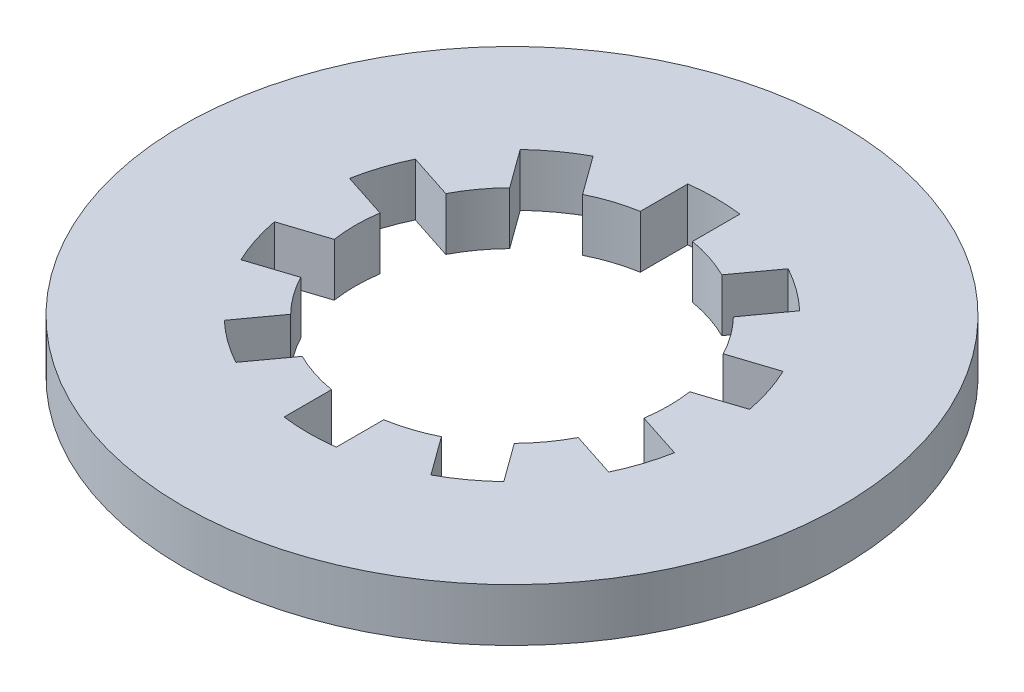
ISO-10303-21;
HEADER;
FILE_DESCRIPTION(('STEP AP214'),'2;1');
FILE_NAME('part.step','',(''),(''),'','','');
FILE_SCHEMA(('AUTOMOTIVE_DESIGN { 1 0 10303 214 1 1 1 1 }'));
ENDSEC;
DATA;
#1=APPLICATION_CONTEXT('core data for automotive mechanical design processes');
#2=APPLICATION_PROTOCOL_DEFINITION('international standard','automotive_design',2000,#1);
#3=PRODUCT_CONTEXT('',#1,'mechanical');
#4=PRODUCT('Part','Part','',(#3));
#5=PRODUCT_RELATED_PRODUCT_CATEGORY('part','',(#4));
#6=PRODUCT_DEFINITION_FORMATION('','',#4);
#7=PRODUCT_DEFINITION_CONTEXT('part definition',#1,'design');
#8=PRODUCT_DEFINITION('design','',#6,#7);
#9=PRODUCT_DEFINITION_SHAPE('','',#8);
#10=(LENGTH_UNIT() NAMED_UNIT(*) SI_UNIT(.MILLI.,.METRE.));
#11=(NAMED_UNIT(*) PLANE_ANGLE_UNIT() SI_UNIT($,.RADIAN.));
#12=(NAMED_UNIT(*) SI_UNIT($,.STERADIAN.) SOLID_ANGLE_UNIT());
#13=UNCERTAINTY_MEASURE_WITH_UNIT(LENGTH_MEASURE(1.E-05),#10,'distance_accuracy_value','');
#14=(GEOMETRIC_REPRESENTATION_CONTEXT(3) GLOBAL_UNCERTAINTY_ASSIGNED_CONTEXT((#13)) GLOBAL_UNIT_ASSIGNED_CONTEXT((#10,
#11,#12)) REPRESENTATION_CONTEXT('',''));
#15=CARTESIAN_POINT('',(0.,0.,0.));
#16=DIRECTION('',(0.,0.,1.));
#17=DIRECTION('',(1.,0.,0.));
#18=AXIS2_PLACEMENT_3D('',#15,#16,#17);
#19=CARTESIAN_POINT('',(0.,0.4064,0.));
#20=DIRECTION('',(0.,-1.,0.));
#21=DIRECTION('',(0.,0.,-1.));
#22=AXIS2_PLACEMENT_3D('',#19,#20,#21);
#23=CYLINDRICAL_SURFACE('',#22,1.2065);
#24=DIRECTION('',(0.,1.,0.));
#25=VECTOR('',#24,1.);
#26=CARTESIAN_POINT('',(-0.536564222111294,0.,1.08062069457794));
#27=LINE('',#26,#25);
#28=CARTESIAN_POINT('',(-0.536564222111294,0.,1.08062069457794));
#29=VERTEX_POINT('',#28);
#30=CARTESIAN_POINT('',(-0.536564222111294,0.4064,1.08062069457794));
#31=VERTEX_POINT('',#30);
#32=EDGE_CURVE('E555',#29,#31,#27,.T.);
#33=ORIENTED_EDGE('',*,*,#32,.T.);
#34=CARTESIAN_POINT('',(0.,0.4064,0.));
#35=DIRECTION('',(0.,1.,0.));
#36=DIRECTION('',(0.,0.,1.));
#37=AXIS2_PLACEMENT_3D('',#34,#35,#36);
#38=CIRCLE('',#37,1.2065);
#39=CARTESIAN_POINT('',(-0.201083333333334,0.4064,1.18962504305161));
#40=VERTEX_POINT('',#39);
#41=EDGE_CURVE('E324',#31,#40,#38,.T.);
#42=ORIENTED_EDGE('',*,*,#41,.T.);
#43=DIRECTION('',(0.,1.,0.));
#44=VECTOR('',#43,1.);
#45=CARTESIAN_POINT('',(-0.201083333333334,0.,1.18962504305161));
#46=LINE('',#45,#44);
#47=CARTESIAN_POINT('',(-0.201083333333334,0.,1.18962504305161));
#48=VERTEX_POINT('',#47);
#49=EDGE_CURVE('E330',#48,#40,#46,.T.);
#50=ORIENTED_EDGE('',*,*,#49,.F.);
#51=CARTESIAN_POINT('',(0.,0.,0.));
#52=DIRECTION('',(0.,1.,0.));
#53=DIRECTION('',(0.,0.,1.));
#54=AXIS2_PLACEMENT_3D('',#51,#52,#53);
#55=CIRCLE('',#54,1.2065);
#56=EDGE_CURVE('E316',#29,#48,#55,.T.);
#57=ORIENTED_EDGE('',*,*,#56,.F.);
#58=EDGE_LOOP('',(#33,#42,#50,#57));
#59=FACE_BOUND('',#58,.T.);
#60=ADVANCED_FACE('F34',(#59),#23,.F.);
#61=DIRECTION('',(0.,1.,0.));
#62=VECTOR('',#61,1.);
#63=CARTESIAN_POINT('',(-0.861923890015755,0.,0.844233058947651));
#64=LINE('',#63,#62);
#65=CARTESIAN_POINT('',(-0.861923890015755,0.,0.844233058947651));
#66=VERTEX_POINT('',#65);
#67=CARTESIAN_POINT('',(-0.861923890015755,0.4064,0.844233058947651));
#68=VERTEX_POINT('',#67);
#69=EDGE_CURVE('E294',#66,#68,#64,.T.);
#70=ORIENTED_EDGE('',*,*,#69,.F.);
#71=CARTESIAN_POINT('',(-1.06926248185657,0.,0.558855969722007));
#72=VERTEX_POINT('',#71);
#73=EDGE_CURVE('E306',#72,#66,#55,.T.);
#74=ORIENTED_EDGE('',*,*,#73,.F.);
#75=DIRECTION('',(0.,1.,0.));
#76=VECTOR('',#75,1.);
#77=CARTESIAN_POINT('',(-1.06926248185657,0.,0.558855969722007));
#78=LINE('',#77,#76);
#79=CARTESIAN_POINT('',(-1.06926248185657,0.4064,0.558855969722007));
#80=VERTEX_POINT('',#79);
#81=EDGE_CURVE('E531',#72,#80,#78,.T.);
#82=ORIENTED_EDGE('',*,*,#81,.T.);
#83=EDGE_CURVE('E308',#80,#68,#38,.T.);
#84=ORIENTED_EDGE('',*,*,#83,.T.);
#85=EDGE_LOOP('',(#70,#74,#82,#84));
#86=FACE_BOUND('',#85,.T.);
#87=ADVANCED_FACE('F304',(#86),#23,.F.);
#88=DIRECTION('',(0.,1.,0.));
#89=VECTOR('',#88,1.);
#90=CARTESIAN_POINT('',(-1.1935388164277,0.,0.176372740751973));
#91=LINE('',#90,#89);
#92=CARTESIAN_POINT('',(-1.1935388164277,0.,0.176372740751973));
#93=VERTEX_POINT('',#92);
#94=CARTESIAN_POINT('',(-1.1935388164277,0.4064,0.176372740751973));
#95=VERTEX_POINT('',#94);
#96=EDGE_CURVE('E539',#93,#95,#91,.T.);
#97=ORIENTED_EDGE('',*,*,#96,.F.);
#98=CARTESIAN_POINT('',(-1.1935388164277,0.,-0.176372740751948));
#99=VERTEX_POINT('',#98);
#100=EDGE_CURVE('E315',#99,#93,#55,.T.);
#101=ORIENTED_EDGE('',*,*,#100,.F.);
#102=DIRECTION('',(0.,1.,0.));
#103=VECTOR('',#102,1.);
#104=CARTESIAN_POINT('',(-1.1935388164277,0.,-0.176372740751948));
#105=LINE('',#104,#103);
#106=CARTESIAN_POINT('',(-1.1935388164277,0.4064,-0.176372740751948));
#107=VERTEX_POINT('',#106);
#108=EDGE_CURVE('E505',#99,#107,#105,.T.);
#109=ORIENTED_EDGE('',*,*,#108,.T.);
#110=EDGE_CURVE('E654',#107,#95,#38,.T.);
#111=ORIENTED_EDGE('',*,*,#110,.T.);
#112=EDGE_LOOP('',(#97,#101,#109,#111));
#113=FACE_BOUND('',#112,.T.);
#114=ADVANCED_FACE('F652',(#113),#23,.F.);
#115=DIRECTION('',(0.,1.,0.));
#116=VECTOR('',#115,1.);
#117=CARTESIAN_POINT('',(-1.06926248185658,0.,-0.558855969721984));
#118=LINE('',#117,#116);
#119=CARTESIAN_POINT('',(-1.06926248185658,0.,-0.558855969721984));
#120=VERTEX_POINT('',#119);
#121=CARTESIAN_POINT('',(-1.06926248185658,0.4064,-0.558855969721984));
#122=VERTEX_POINT('',#121);
#123=EDGE_CURVE('E513',#120,#122,#118,.T.);
#124=ORIENTED_EDGE('',*,*,#123,.F.);
#125=CARTESIAN_POINT('',(-0.861923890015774,0.,-0.844233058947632));
#126=VERTEX_POINT('',#125);
#127=EDGE_CURVE('E319',#126,#120,#55,.T.);
#128=ORIENTED_EDGE('',*,*,#127,.F.);
#129=DIRECTION('',(0.,1.,0.));
#130=VECTOR('',#129,1.);
#131=CARTESIAN_POINT('',(-0.861923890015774,0.,-0.844233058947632));
#132=LINE('',#131,#130);
#133=CARTESIAN_POINT('',(-0.861923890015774,0.4064,-0.844233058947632));
#134=VERTEX_POINT('',#133);
#135=EDGE_CURVE('E479',#126,#134,#132,.T.);
#136=ORIENTED_EDGE('',*,*,#135,.T.);
#137=EDGE_CURVE('E636',#134,#122,#38,.T.);
#138=ORIENTED_EDGE('',*,*,#137,.T.);
#139=EDGE_LOOP('',(#124,#128,#136,#138));
#140=FACE_BOUND('',#139,.T.);
#141=ADVANCED_FACE('F633',(#140),#23,.F.);
#142=DIRECTION('',(0.,1.,0.));
#143=VECTOR('',#142,1.);
#144=CARTESIAN_POINT('',(-0.536564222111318,0.,-1.08062069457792));
#145=LINE('',#144,#143);
#146=CARTESIAN_POINT('',(-0.536564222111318,0.,-1.08062069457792));
#147=VERTEX_POINT('',#146);
#148=CARTESIAN_POINT('',(-0.536564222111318,0.4064,-1.08062069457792));
#149=VERTEX_POINT('',#148);
#150=EDGE_CURVE('E487',#147,#149,#145,.T.);
#151=ORIENTED_EDGE('',*,*,#150,.F.);
#152=CARTESIAN_POINT('',(-0.201083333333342,0.,-1.18962504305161));
#153=VERTEX_POINT('',#152);
#154=EDGE_CURVE('E624',#153,#147,#55,.T.);
#155=ORIENTED_EDGE('',*,*,#154,.F.);
#156=DIRECTION('',(0.,1.,0.));
#157=VECTOR('',#156,1.);
#158=CARTESIAN_POINT('',(-0.201083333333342,0.,-1.18962504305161));
#159=LINE('',#158,#157);
#160=CARTESIAN_POINT('',(-0.201083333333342,0.4064,-1.18962504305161));
#161=VERTEX_POINT('',#160);
#162=EDGE_CURVE('E453',#153,#161,#159,.T.);
#163=ORIENTED_EDGE('',*,*,#162,.T.);
#164=EDGE_CURVE('E664',#161,#149,#38,.T.);
#165=ORIENTED_EDGE('',*,*,#164,.T.);
#166=EDGE_LOOP('',(#151,#155,#163,#165));
#167=FACE_BOUND('',#166,.T.);
#168=ADVANCED_FACE('F731',(#167),#23,.F.);
#169=DIRECTION('',(0.,1.,0.));
#170=VECTOR('',#169,1.);
#171=CARTESIAN_POINT('',(0.201083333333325,0.,-1.18962504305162));
#172=LINE('',#171,#170);
#173=CARTESIAN_POINT('',(0.201083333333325,0.,-1.18962504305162));
#174=VERTEX_POINT('',#173);
#175=CARTESIAN_POINT('',(0.201083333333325,0.4064,-1.18962504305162));
#176=VERTEX_POINT('',#175);
#177=EDGE_CURVE('E461',#174,#176,#172,.T.);
#178=ORIENTED_EDGE('',*,*,#177,.F.);
#179=CARTESIAN_POINT('',(0.536564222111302,0.,-1.08062069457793));
#180=VERTEX_POINT('',#179);
#181=EDGE_CURVE('E621',#180,#174,#55,.T.);
#182=ORIENTED_EDGE('',*,*,#181,.F.);
#183=DIRECTION('',(0.,1.,0.));
#184=VECTOR('',#183,1.);
#185=CARTESIAN_POINT('',(0.536564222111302,0.,-1.08062069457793));
#186=LINE('',#185,#184);
#187=CARTESIAN_POINT('',(0.536564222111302,0.4064,-1.08062069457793));
#188=VERTEX_POINT('',#187);
#189=EDGE_CURVE('E427',#180,#188,#186,.T.);
#190=ORIENTED_EDGE('',*,*,#189,.T.);
#191=EDGE_CURVE('E666',#188,#176,#38,.T.);
#192=ORIENTED_EDGE('',*,*,#191,.T.);
#193=EDGE_LOOP('',(#178,#182,#190,#192));
#194=FACE_BOUND('',#193,.T.);
#195=ADVANCED_FACE('F719',(#194),#23,.F.);
#196=DIRECTION('',(0.,1.,0.));
#197=VECTOR('',#196,1.);
#198=CARTESIAN_POINT('',(0.861923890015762,0.,-0.844233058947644));
#199=LINE('',#198,#197);
#200=CARTESIAN_POINT('',(0.861923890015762,0.,-0.844233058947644));
#201=VERTEX_POINT('',#200);
#202=CARTESIAN_POINT('',(0.861923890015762,0.4064,-0.844233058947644));
#203=VERTEX_POINT('',#202);
#204=EDGE_CURVE('E435',#201,#203,#199,.T.);
#205=ORIENTED_EDGE('',*,*,#204,.F.);
#206=CARTESIAN_POINT('',(1.06926248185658,0.,-0.558855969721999));
#207=VERTEX_POINT('',#206);
#208=EDGE_CURVE('E618',#207,#201,#55,.T.);
#209=ORIENTED_EDGE('',*,*,#208,.F.);
#210=DIRECTION('',(0.,1.,0.));
#211=VECTOR('',#210,1.);
#212=CARTESIAN_POINT('',(1.06926248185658,0.,-0.558855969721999));
#213=LINE('',#212,#211);
#214=CARTESIAN_POINT('',(1.06926248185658,0.4064,-0.558855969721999));
#215=VERTEX_POINT('',#214);
#216=EDGE_CURVE('E401',#207,#215,#213,.T.);
#217=ORIENTED_EDGE('',*,*,#216,.T.);
#218=EDGE_CURVE('E671',#215,#203,#38,.T.);
#219=ORIENTED_EDGE('',*,*,#218,.T.);
#220=EDGE_LOOP('',(#205,#209,#217,#219));
#221=FACE_BOUND('',#220,.T.);
#222=ADVANCED_FACE('F707',(#221),#23,.F.);
#223=DIRECTION('',(0.,1.,0.));
#224=VECTOR('',#223,1.);
#225=CARTESIAN_POINT('',(1.1935388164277,0.,-0.176372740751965));
#226=LINE('',#225,#224);
#227=CARTESIAN_POINT('',(1.1935388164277,0.,-0.176372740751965));
#228=VERTEX_POINT('',#227);
#229=CARTESIAN_POINT('',(1.1935388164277,0.4064,-0.176372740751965));
#230=VERTEX_POINT('',#229);
#231=EDGE_CURVE('E409',#228,#230,#226,.T.);
#232=ORIENTED_EDGE('',*,*,#231,.F.);
#233=CARTESIAN_POINT('',(1.1935388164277,0.,0.176372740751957));
#234=VERTEX_POINT('',#233);
#235=EDGE_CURVE('E616',#234,#228,#55,.T.);
#236=ORIENTED_EDGE('',*,*,#235,.F.);
#237=DIRECTION('',(0.,1.,0.));
#238=VECTOR('',#237,1.);
#239=CARTESIAN_POINT('',(1.1935388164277,0.,0.176372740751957));
#240=LINE('',#239,#238);
#241=CARTESIAN_POINT('',(1.1935388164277,0.4064,0.176372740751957));
#242=VERTEX_POINT('',#241);
#243=EDGE_CURVE('E375',#234,#242,#240,.T.);
#244=ORIENTED_EDGE('',*,*,#243,.T.);
#245=EDGE_CURVE('E676',#242,#230,#38,.T.);
#246=ORIENTED_EDGE('',*,*,#245,.T.);
#247=EDGE_LOOP('',(#232,#236,#244,#246));
#248=FACE_BOUND('',#247,.T.);
#249=ADVANCED_FACE('F695',(#248),#23,.F.);
#250=DIRECTION('',(0.,1.,0.));
#251=VECTOR('',#250,1.);
#252=CARTESIAN_POINT('',(1.06926248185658,0.,0.558855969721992));
#253=LINE('',#252,#251);
#254=CARTESIAN_POINT('',(1.06926248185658,0.,0.558855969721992));
#255=VERTEX_POINT('',#254);
#256=CARTESIAN_POINT('',(1.06926248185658,0.4064,0.558855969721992));
#257=VERTEX_POINT('',#256);
#258=EDGE_CURVE('E383',#255,#257,#253,.T.);
#259=ORIENTED_EDGE('',*,*,#258,.F.);
#260=CARTESIAN_POINT('',(0.861923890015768,0.,0.844233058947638));
#261=VERTEX_POINT('',#260);
#262=EDGE_CURVE('E325',#261,#255,#55,.T.);
#263=ORIENTED_EDGE('',*,*,#262,.F.);
#264=DIRECTION('',(0.,1.,0.));
#265=VECTOR('',#264,1.);
#266=CARTESIAN_POINT('',(0.861923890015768,0.,0.844233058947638));
#267=LINE('',#266,#265);
#268=CARTESIAN_POINT('',(0.861923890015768,0.4064,0.844233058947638));
#269=VERTEX_POINT('',#268);
#270=EDGE_CURVE('E349',#261,#269,#267,.T.);
#271=ORIENTED_EDGE('',*,*,#270,.T.);
#272=EDGE_CURVE('E329',#269,#257,#38,.T.);
#273=ORIENTED_EDGE('',*,*,#272,.T.);
#274=EDGE_LOOP('',(#259,#263,#271,#273));
#275=FACE_BOUND('',#274,.T.);
#276=ADVANCED_FACE('F614',(#275),#23,.F.);
#277=CARTESIAN_POINT('',(0.,0.4064,0.));
#278=DIRECTION('',(0.,1.,0.));
#279=DIRECTION('',(0.,0.,1.));
#280=AXIS2_PLACEMENT_3D('',#277,#278,#279);
#281=PLANE('',#280);
#282=DIRECTION('',(0.587785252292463,0.,-0.809016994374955));
#283=VECTOR('',#282,1.);
#284=CARTESIAN_POINT('',(-0.751624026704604,0.4064,1.37662512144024));
#285=LINE('',#284,#283);
#286=CARTESIAN_POINT('',(-0.751624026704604,0.4064,1.37662512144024));
#287=VERTEX_POINT('',#286);
#288=EDGE_CURVE('E299',#287,#31,#285,.T.);
#289=ORIENTED_EDGE('',*,*,#288,.F.);
#290=CARTESIAN_POINT('',(0.,0.4064,0.));
#291=DIRECTION('',(0.,1.,0.));
#292=DIRECTION('',(-0.587785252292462,0.,0.809016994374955));
#293=AXIS2_PLACEMENT_3D('',#290,#291,#292);
#294=CIRCLE('',#293,1.56845);
#295=CARTESIAN_POINT('',(-1.07698369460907,0.4064,1.14023748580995));
#296=VERTEX_POINT('',#295);
#297=EDGE_CURVE('E566',#296,#287,#294,.T.);
#298=ORIENTED_EDGE('',*,*,#297,.F.);
#299=DIRECTION('',(-0.587785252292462,0.,0.809016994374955));
#300=VECTOR('',#299,1.);
#301=CARTESIAN_POINT('',(-1.07698369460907,0.4064,1.14023748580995));
#302=LINE('',#301,#300);
#303=EDGE_CURVE('E569',#68,#296,#302,.T.);
#304=ORIENTED_EDGE('',*,*,#303,.F.);
#305=ORIENTED_EDGE('',*,*,#83,.F.);
#306=DIRECTION('',(0.95105651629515,0.,-0.309016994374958));
#307=VECTOR('',#306,1.);
#308=CARTESIAN_POINT('',(-1.41723655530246,0.4064,0.671919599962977));
#309=LINE('',#308,#307);
#310=CARTESIAN_POINT('',(-1.41723655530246,0.4064,0.671919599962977));
#311=VERTEX_POINT('',#310);
#312=EDGE_CURVE('E546',#311,#80,#309,.T.);
#313=ORIENTED_EDGE('',*,*,#312,.F.);
#314=CARTESIAN_POINT('',(0.,0.4064,0.));
#315=DIRECTION('',(0.,1.,0.));
#316=DIRECTION('',(-0.95105651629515,0.,0.309016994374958));
#317=AXIS2_PLACEMENT_3D('',#314,#315,#316);
#318=CIRCLE('',#317,1.56845);
#319=CARTESIAN_POINT('',(-1.54151288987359,0.4064,0.289436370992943));
#320=VERTEX_POINT('',#319);
#321=EDGE_CURVE('E549',#320,#311,#318,.T.);
#322=ORIENTED_EDGE('',*,*,#321,.F.);
#323=DIRECTION('',(-0.95105651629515,0.,0.309016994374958));
#324=VECTOR('',#323,1.);
#325=CARTESIAN_POINT('',(-1.54151288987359,0.4064,0.289436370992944));
#326=LINE('',#325,#324);
#327=EDGE_CURVE('E552',#95,#320,#326,.T.);
#328=ORIENTED_EDGE('',*,*,#327,.F.);
#329=ORIENTED_EDGE('',*,*,#110,.F.);
#330=DIRECTION('',(0.951056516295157,0.,0.309016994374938));
#331=VECTOR('',#330,1.);
#332=CARTESIAN_POINT('',(-1.5415128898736,0.4064,-0.289436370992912));
#333=LINE('',#332,#331);
#334=CARTESIAN_POINT('',(-1.5415128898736,0.4064,-0.289436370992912));
#335=VERTEX_POINT('',#334);
#336=EDGE_CURVE('E522',#335,#107,#333,.T.);
#337=ORIENTED_EDGE('',*,*,#336,.F.);
#338=CARTESIAN_POINT('',(0.,0.4064,0.));
#339=DIRECTION('',(0.,1.,0.));
#340=DIRECTION('',(-0.951056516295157,0.,-0.309016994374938));
#341=AXIS2_PLACEMENT_3D('',#338,#339,#340);
#342=CIRCLE('',#341,1.56845);
#343=CARTESIAN_POINT('',(-1.41723655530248,0.4064,-0.671919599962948));
#344=VERTEX_POINT('',#343);
#345=EDGE_CURVE('E525',#344,#335,#342,.T.);
#346=ORIENTED_EDGE('',*,*,#345,.F.);
#347=DIRECTION('',(-0.951056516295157,0.,-0.309016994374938));
#348=VECTOR('',#347,1.);
#349=CARTESIAN_POINT('',(-1.41723655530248,0.4064,-0.671919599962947));
#350=LINE('',#349,#348);
#351=EDGE_CURVE('E528',#122,#344,#350,.T.);
#352=ORIENTED_EDGE('',*,*,#351,.F.);
#353=ORIENTED_EDGE('',*,*,#137,.F.);
#354=DIRECTION('',(0.58778525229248,0.,0.809016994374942));
#355=VECTOR('',#354,1.);
#356=CARTESIAN_POINT('',(-1.07698369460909,0.4064,-1.14023748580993));
#357=LINE('',#356,#355);
#358=CARTESIAN_POINT('',(-1.07698369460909,0.4064,-1.14023748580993));
#359=VERTEX_POINT('',#358);
#360=EDGE_CURVE('E496',#359,#134,#357,.T.);
#361=ORIENTED_EDGE('',*,*,#360,.F.);
#362=CARTESIAN_POINT('',(0.,0.4064,0.));
#363=DIRECTION('',(0.,1.,0.));
#364=DIRECTION('',(-0.58778525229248,0.,-0.809016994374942));
#365=AXIS2_PLACEMENT_3D('',#362,#363,#364);
#366=CIRCLE('',#365,1.56845);
#367=CARTESIAN_POINT('',(-0.751624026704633,0.4064,-1.37662512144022));
#368=VERTEX_POINT('',#367);
#369=EDGE_CURVE('E499',#368,#359,#366,.T.);
#370=ORIENTED_EDGE('',*,*,#369,.F.);
#371=DIRECTION('',(-0.58778525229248,0.,-0.809016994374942));
#372=VECTOR('',#371,1.);
#373=CARTESIAN_POINT('',(-0.751624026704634,0.4064,-1.37662512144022));
#374=LINE('',#373,#372);
#375=EDGE_CURVE('E502',#149,#368,#374,.T.);
#376=ORIENTED_EDGE('',*,*,#375,.F.);
#377=ORIENTED_EDGE('',*,*,#164,.F.);
#378=DIRECTION('',(0.,0.,1.));
#379=VECTOR('',#378,1.);
#380=CARTESIAN_POINT('',(-0.201083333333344,0.4064,-1.55550663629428));
#381=LINE('',#380,#379);
#382=CARTESIAN_POINT('',(-0.201083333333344,0.4064,-1.55550663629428));
#383=VERTEX_POINT('',#382);
#384=EDGE_CURVE('E470',#383,#161,#381,.T.);
#385=ORIENTED_EDGE('',*,*,#384,.F.);
#386=CARTESIAN_POINT('',(0.,0.4064,0.));
#387=DIRECTION('',(0.,1.,0.));
#388=DIRECTION('',(0.,0.,-1.));
#389=AXIS2_PLACEMENT_3D('',#386,#387,#388);
#390=CIRCLE('',#389,1.56845);
#391=CARTESIAN_POINT('',(0.201083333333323,0.4064,-1.55550663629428));
#392=VERTEX_POINT('',#391);
#393=EDGE_CURVE('E473',#392,#383,#390,.T.);
#394=ORIENTED_EDGE('',*,*,#393,.F.);
#395=DIRECTION('',(0.,0.,-1.));
#396=VECTOR('',#395,1.);
#397=CARTESIAN_POINT('',(0.201083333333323,0.4064,-1.55550663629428));
#398=LINE('',#397,#396);
#399=EDGE_CURVE('E476',#176,#392,#398,.T.);
#400=ORIENTED_EDGE('',*,*,#399,.F.);
#401=ORIENTED_EDGE('',*,*,#191,.F.);
#402=DIRECTION('',(-0.587785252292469,0.,0.809016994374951));
#403=VECTOR('',#402,1.);
#404=CARTESIAN_POINT('',(0.751624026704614,0.4064,-1.37662512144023));
#405=LINE('',#404,#403);
#406=CARTESIAN_POINT('',(0.751624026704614,0.4064,-1.37662512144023));
#407=VERTEX_POINT('',#406);
#408=EDGE_CURVE('E444',#407,#188,#405,.T.);
#409=ORIENTED_EDGE('',*,*,#408,.F.);
#410=CARTESIAN_POINT('',(0.,0.4064,0.));
#411=DIRECTION('',(0.,1.,0.));
#412=DIRECTION('',(0.587785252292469,0.,-0.809016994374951));
#413=AXIS2_PLACEMENT_3D('',#410,#411,#412);
#414=CIRCLE('',#413,1.56845);
#415=CARTESIAN_POINT('',(1.07698369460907,0.4064,-1.14023748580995));
#416=VERTEX_POINT('',#415);
#417=EDGE_CURVE('E447',#416,#407,#414,.T.);
#418=ORIENTED_EDGE('',*,*,#417,.F.);
#419=DIRECTION('',(0.587785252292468,0.,-0.809016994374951));
#420=VECTOR('',#419,1.);
#421=CARTESIAN_POINT('',(1.07698369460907,0.4064,-1.14023748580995));
#422=LINE('',#421,#420);
#423=EDGE_CURVE('E450',#203,#416,#422,.T.);
#424=ORIENTED_EDGE('',*,*,#423,.F.);
#425=ORIENTED_EDGE('',*,*,#218,.F.);
#426=DIRECTION('',(-0.951056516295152,0.,0.309016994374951));
#427=VECTOR('',#426,1.);
#428=CARTESIAN_POINT('',(1.41723655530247,0.4064,-0.671919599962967));
#429=LINE('',#428,#427);
#430=CARTESIAN_POINT('',(1.41723655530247,0.4064,-0.671919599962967));
#431=VERTEX_POINT('',#430);
#432=EDGE_CURVE('E418',#431,#215,#429,.T.);
#433=ORIENTED_EDGE('',*,*,#432,.F.);
#434=CARTESIAN_POINT('',(0.,0.4064,0.));
#435=DIRECTION('',(0.,1.,0.));
#436=DIRECTION('',(0.951056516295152,0.,-0.309016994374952));
#437=AXIS2_PLACEMENT_3D('',#434,#435,#436);
#438=CIRCLE('',#437,1.56845);
#439=CARTESIAN_POINT('',(1.54151288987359,0.4064,-0.289436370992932));
#440=VERTEX_POINT('',#439);
#441=EDGE_CURVE('E421',#440,#431,#438,.T.);
#442=ORIENTED_EDGE('',*,*,#441,.F.);
#443=DIRECTION('',(0.951056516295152,0.,-0.309016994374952));
#444=VECTOR('',#443,1.);
#445=CARTESIAN_POINT('',(1.54151288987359,0.4064,-0.289436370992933));
#446=LINE('',#445,#444);
#447=EDGE_CURVE('E424',#230,#440,#446,.T.);
#448=ORIENTED_EDGE('',*,*,#447,.F.);
#449=ORIENTED_EDGE('',*,*,#245,.F.);
#450=DIRECTION('',(-0.951056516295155,0.,-0.309016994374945));
#451=VECTOR('',#450,1.);
#452=CARTESIAN_POINT('',(1.5415128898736,0.4064,0.289436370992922));
#453=LINE('',#452,#451);
#454=CARTESIAN_POINT('',(1.5415128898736,0.4064,0.289436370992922));
#455=VERTEX_POINT('',#454);
#456=EDGE_CURVE('E392',#455,#242,#453,.T.);
#457=ORIENTED_EDGE('',*,*,#456,.F.);
#458=CARTESIAN_POINT('',(0.,0.4064,0.));
#459=DIRECTION('',(0.,1.,0.));
#460=DIRECTION('',(0.951056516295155,0.,0.309016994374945));
#461=AXIS2_PLACEMENT_3D('',#458,#459,#460);
#462=CIRCLE('',#461,1.56845);
#463=CARTESIAN_POINT('',(1.41723655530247,0.4064,0.671919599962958));
#464=VERTEX_POINT('',#463);
#465=EDGE_CURVE('E395',#464,#455,#462,.T.);
#466=ORIENTED_EDGE('',*,*,#465,.F.);
#467=DIRECTION('',(0.951056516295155,0.,0.309016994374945));
#468=VECTOR('',#467,1.);
#469=CARTESIAN_POINT('',(1.41723655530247,0.4064,0.671919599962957));
#470=LINE('',#469,#468);
#471=EDGE_CURVE('E398',#257,#464,#470,.T.);
#472=ORIENTED_EDGE('',*,*,#471,.F.);
#473=ORIENTED_EDGE('',*,*,#272,.F.);
#474=DIRECTION('',(-0.587785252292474,0.,-0.809016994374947));
#475=VECTOR('',#474,1.);
#476=CARTESIAN_POINT('',(1.07698369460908,0.4064,1.14023748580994));
#477=LINE('',#476,#475);
#478=CARTESIAN_POINT('',(1.07698369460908,0.4064,1.14023748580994));
#479=VERTEX_POINT('',#478);
#480=EDGE_CURVE('E366',#479,#269,#477,.T.);
#481=ORIENTED_EDGE('',*,*,#480,.F.);
#482=CARTESIAN_POINT('',(0.,0.4064,0.));
#483=DIRECTION('',(0.,1.,0.));
#484=DIRECTION('',(0.587785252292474,0.,0.809016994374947));
#485=AXIS2_PLACEMENT_3D('',#482,#483,#484);
#486=CIRCLE('',#485,1.56845);
#487=CARTESIAN_POINT('',(0.751624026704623,0.4064,1.37662512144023));
#488=VERTEX_POINT('',#487);
#489=EDGE_CURVE('E369',#488,#479,#486,.T.);
#490=ORIENTED_EDGE('',*,*,#489,.F.);
#491=DIRECTION('',(0.587785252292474,0.,0.809016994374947));
#492=VECTOR('',#491,1.);
#493=CARTESIAN_POINT('',(0.751624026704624,0.4064,1.37662512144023));
#494=LINE('',#493,#492);
#495=CARTESIAN_POINT('',(0.53656422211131,0.4064,1.08062069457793));
#496=VERTEX_POINT('',#495);
#497=EDGE_CURVE('E372',#496,#488,#494,.T.);
#498=ORIENTED_EDGE('',*,*,#497,.F.);
#499=CARTESIAN_POINT('',(0.201083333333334,0.4064,1.18962504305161));
#500=VERTEX_POINT('',#499);
#501=EDGE_CURVE('E326',#500,#496,#38,.T.);
#502=ORIENTED_EDGE('',*,*,#501,.F.);
#503=DIRECTION('',(0.,0.,-1.));
#504=VECTOR('',#503,1.);
#505=CARTESIAN_POINT('',(0.201083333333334,0.4064,1.55550663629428));
#506=LINE('',#505,#504);
#507=CARTESIAN_POINT('',(0.201083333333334,0.4064,1.55550663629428));
#508=VERTEX_POINT('',#507);
#509=EDGE_CURVE('E340',#508,#500,#506,.T.);
#510=ORIENTED_EDGE('',*,*,#509,.F.);
#511=CARTESIAN_POINT('',(0.,0.4064,0.));
#512=DIRECTION('',(0.,1.,0.));
#513=DIRECTION('',(0.,0.,1.));
#514=AXIS2_PLACEMENT_3D('',#511,#512,#513);
#515=CIRCLE('',#514,1.56845);
#516=CARTESIAN_POINT('',(-0.201083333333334,0.4064,1.55550663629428));
#517=VERTEX_POINT('',#516);
#518=EDGE_CURVE('E343',#517,#508,#515,.T.);
#519=ORIENTED_EDGE('',*,*,#518,.F.);
#520=DIRECTION('',(0.,0.,1.));
#521=VECTOR('',#520,1.);
#522=CARTESIAN_POINT('',(-0.201083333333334,0.4064,1.55550663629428));
#523=LINE('',#522,#521);
#524=EDGE_CURVE('E346',#40,#517,#523,.T.);
#525=ORIENTED_EDGE('',*,*,#524,.F.);
#526=ORIENTED_EDGE('',*,*,#41,.F.);
#527=EDGE_LOOP('',(#289,#298,#304,#305,#313,#322,#328,#329,#337,#346,#352,#353,#361,#370,#376,
#377,#385,#394,#400,#401,#409,#418,#424,#425,#433,#442,#448,#449,#457,#466,#472,#473,#481,#490,
#498,#502,#510,#519,#525,#526));
#528=FACE_BOUND('',#527,.T.);
#529=CARTESIAN_POINT('',(0.,0.4064,0.));
#530=DIRECTION('',(0.,1.,0.));
#531=DIRECTION('',(0.,0.,1.));
#532=AXIS2_PLACEMENT_3D('',#529,#530,#531);
#533=CIRCLE('',#532,2.54);
#534=CARTESIAN_POINT('',(0.,0.4064,2.54));
#535=VERTEX_POINT('',#534);
#536=EDGE_CURVE('E11',#535,#535,#533,.T.);
#537=ORIENTED_EDGE('',*,*,#536,.T.);
#538=EDGE_LOOP('',(#537));
#539=FACE_BOUND('',#538,.T.);
#540=ADVANCED_FACE('F586',(#528,#539),#281,.T.);
#541=CARTESIAN_POINT('',(0.,0.,0.));
#542=DIRECTION('',(0.,1.,0.));
#543=DIRECTION('',(0.,0.,1.));
#544=AXIS2_PLACEMENT_3D('',#541,#542,#543);
#545=PLANE('',#544);
#546=CARTESIAN_POINT('',(0.,0.,0.));
#547=DIRECTION('',(0.,1.,0.));
#548=DIRECTION('',(0.,0.,1.));
#549=AXIS2_PLACEMENT_3D('',#546,#547,#548);
#550=CIRCLE('',#549,2.54);
#551=CARTESIAN_POINT('',(0.,0.,2.54));
#552=VERTEX_POINT('',#551);
#553=EDGE_CURVE('E38',#552,#552,#550,.T.);
#554=ORIENTED_EDGE('',*,*,#553,.F.);
#555=EDGE_LOOP('',(#554));
#556=FACE_BOUND('',#555,.T.);
#557=CARTESIAN_POINT('',(0.,0.,0.));
#558=DIRECTION('',(0.,1.,0.));
#559=DIRECTION('',(-0.587785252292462,0.,0.809016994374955));
#560=AXIS2_PLACEMENT_3D('',#557,#558,#559);
#561=CIRCLE('',#560,1.56845);
#562=CARTESIAN_POINT('',(-1.07698369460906,0.,1.14023748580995));
#563=VERTEX_POINT('',#562);
#564=CARTESIAN_POINT('',(-0.751624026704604,0.,1.37662512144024));
#565=VERTEX_POINT('',#564);
#566=EDGE_CURVE('E49',#563,#565,#561,.T.);
#567=ORIENTED_EDGE('',*,*,#566,.T.);
#568=DIRECTION('',(0.587785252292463,0.,-0.809016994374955));
#569=VECTOR('',#568,1.);
#570=CARTESIAN_POINT('',(-0.751624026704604,0.,1.37662512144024));
#571=LINE('',#570,#569);
#572=EDGE_CURVE('E309',#565,#29,#571,.T.);
#573=ORIENTED_EDGE('',*,*,#572,.T.);
#574=ORIENTED_EDGE('',*,*,#56,.T.);
#575=DIRECTION('',(0.,0.,1.));
#576=VECTOR('',#575,1.);
#577=CARTESIAN_POINT('',(-0.201083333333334,0.,1.55550663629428));
#578=LINE('',#577,#576);
#579=CARTESIAN_POINT('',(-0.201083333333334,0.,1.55550663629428));
#580=VERTEX_POINT('',#579);
#581=EDGE_CURVE('E342',#48,#580,#578,.T.);
#582=ORIENTED_EDGE('',*,*,#581,.T.);
#583=CARTESIAN_POINT('',(0.,0.,0.));
#584=DIRECTION('',(0.,1.,0.));
#585=DIRECTION('',(0.,0.,1.));
#586=AXIS2_PLACEMENT_3D('',#583,#584,#585);
#587=CIRCLE('',#586,1.56845);
#588=CARTESIAN_POINT('',(0.201083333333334,0.,1.55550663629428));
#589=VERTEX_POINT('',#588);
#590=EDGE_CURVE('E352',#580,#589,#587,.T.);
#591=ORIENTED_EDGE('',*,*,#590,.T.);
#592=DIRECTION('',(0.,0.,-1.));
#593=VECTOR('',#592,1.);
#594=CARTESIAN_POINT('',(0.201083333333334,0.,1.55550663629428));
#595=LINE('',#594,#593);
#596=CARTESIAN_POINT('',(0.201083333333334,0.,1.18962504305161));
#597=VERTEX_POINT('',#596);
#598=EDGE_CURVE('E334',#589,#597,#595,.T.);
#599=ORIENTED_EDGE('',*,*,#598,.T.);
#600=CARTESIAN_POINT('',(0.53656422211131,0.,1.08062069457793));
#601=VERTEX_POINT('',#600);
#602=EDGE_CURVE('E321',#597,#601,#55,.T.);
#603=ORIENTED_EDGE('',*,*,#602,.T.);
#604=DIRECTION('',(0.587785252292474,0.,0.809016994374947));
#605=VECTOR('',#604,1.);
#606=CARTESIAN_POINT('',(0.751624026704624,0.,1.37662512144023));
#607=LINE('',#606,#605);
#608=CARTESIAN_POINT('',(0.751624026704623,0.,1.37662512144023));
#609=VERTEX_POINT('',#608);
#610=EDGE_CURVE('E368',#601,#609,#607,.T.);
#611=ORIENTED_EDGE('',*,*,#610,.T.);
#612=CARTESIAN_POINT('',(0.,0.,0.));
#613=DIRECTION('',(0.,1.,0.));
#614=DIRECTION('',(0.587785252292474,0.,0.809016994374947));
#615=AXIS2_PLACEMENT_3D('',#612,#613,#614);
#616=CIRCLE('',#615,1.56845);
#617=CARTESIAN_POINT('',(1.07698369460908,0.,1.14023748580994));
#618=VERTEX_POINT('',#617);
#619=EDGE_CURVE('E378',#609,#618,#616,.T.);
#620=ORIENTED_EDGE('',*,*,#619,.T.);
#621=DIRECTION('',(-0.587785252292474,0.,-0.809016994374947));
#622=VECTOR('',#621,1.);
#623=CARTESIAN_POINT('',(1.07698369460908,0.,1.14023748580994));
#624=LINE('',#623,#622);
#625=EDGE_CURVE('E360',#618,#261,#624,.T.);
#626=ORIENTED_EDGE('',*,*,#625,.T.);
#627=ORIENTED_EDGE('',*,*,#262,.T.);
#628=DIRECTION('',(0.951056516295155,0.,0.309016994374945));
#629=VECTOR('',#628,1.);
#630=CARTESIAN_POINT('',(1.41723655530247,0.,0.671919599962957));
#631=LINE('',#630,#629);
#632=CARTESIAN_POINT('',(1.41723655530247,0.,0.671919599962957));
#633=VERTEX_POINT('',#632);
#634=EDGE_CURVE('E394',#255,#633,#631,.T.);
#635=ORIENTED_EDGE('',*,*,#634,.T.);
#636=CARTESIAN_POINT('',(0.,0.,0.));
#637=DIRECTION('',(0.,1.,0.));
#638=DIRECTION('',(0.951056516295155,0.,0.309016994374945));
#639=AXIS2_PLACEMENT_3D('',#636,#637,#638);
#640=CIRCLE('',#639,1.56845);
#641=CARTESIAN_POINT('',(1.5415128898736,0.,0.289436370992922));
#642=VERTEX_POINT('',#641);
#643=EDGE_CURVE('E404',#633,#642,#640,.T.);
#644=ORIENTED_EDGE('',*,*,#643,.T.);
#645=DIRECTION('',(-0.951056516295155,0.,-0.309016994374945));
#646=VECTOR('',#645,1.);
#647=CARTESIAN_POINT('',(1.5415128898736,0.,0.289436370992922));
#648=LINE('',#647,#646);
#649=EDGE_CURVE('E386',#642,#234,#648,.T.);
#650=ORIENTED_EDGE('',*,*,#649,.T.);
#651=ORIENTED_EDGE('',*,*,#235,.T.);
#652=DIRECTION('',(0.951056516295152,0.,-0.309016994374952));
#653=VECTOR('',#652,1.);
#654=CARTESIAN_POINT('',(1.54151288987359,0.,-0.289436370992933));
#655=LINE('',#654,#653);
#656=CARTESIAN_POINT('',(1.54151288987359,0.,-0.289436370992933));
#657=VERTEX_POINT('',#656);
#658=EDGE_CURVE('E420',#228,#657,#655,.T.);
#659=ORIENTED_EDGE('',*,*,#658,.T.);
#660=CARTESIAN_POINT('',(0.,0.,0.));
#661=DIRECTION('',(0.,1.,0.));
#662=DIRECTION('',(0.951056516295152,0.,-0.309016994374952));
#663=AXIS2_PLACEMENT_3D('',#660,#661,#662);
#664=CIRCLE('',#663,1.56845);
#665=CARTESIAN_POINT('',(1.41723655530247,0.,-0.671919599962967));
#666=VERTEX_POINT('',#665);
#667=EDGE_CURVE('E430',#657,#666,#664,.T.);
#668=ORIENTED_EDGE('',*,*,#667,.T.);
#669=DIRECTION('',(-0.951056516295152,0.,0.309016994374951));
#670=VECTOR('',#669,1.);
#671=CARTESIAN_POINT('',(1.41723655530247,0.,-0.671919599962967));
#672=LINE('',#671,#670);
#673=EDGE_CURVE('E412',#666,#207,#672,.T.);
#674=ORIENTED_EDGE('',*,*,#673,.T.);
#675=ORIENTED_EDGE('',*,*,#208,.T.);
#676=DIRECTION('',(0.587785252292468,0.,-0.809016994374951));
#677=VECTOR('',#676,1.);
#678=CARTESIAN_POINT('',(1.07698369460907,0.,-1.14023748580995));
#679=LINE('',#678,#677);
#680=CARTESIAN_POINT('',(1.07698369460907,0.,-1.14023748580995));
#681=VERTEX_POINT('',#680);
#682=EDGE_CURVE('E446',#201,#681,#679,.T.);
#683=ORIENTED_EDGE('',*,*,#682,.T.);
#684=CARTESIAN_POINT('',(0.,0.,0.));
#685=DIRECTION('',(0.,1.,0.));
#686=DIRECTION('',(0.587785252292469,0.,-0.809016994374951));
#687=AXIS2_PLACEMENT_3D('',#684,#685,#686);
#688=CIRCLE('',#687,1.56845);
#689=CARTESIAN_POINT('',(0.751624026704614,0.,-1.37662512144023));
#690=VERTEX_POINT('',#689);
#691=EDGE_CURVE('E456',#681,#690,#688,.T.);
#692=ORIENTED_EDGE('',*,*,#691,.T.);
#693=DIRECTION('',(-0.587785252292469,0.,0.809016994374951));
#694=VECTOR('',#693,1.);
#695=CARTESIAN_POINT('',(0.751624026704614,0.,-1.37662512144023));
#696=LINE('',#695,#694);
#697=EDGE_CURVE('E438',#690,#180,#696,.T.);
#698=ORIENTED_EDGE('',*,*,#697,.T.);
#699=ORIENTED_EDGE('',*,*,#181,.T.);
#700=DIRECTION('',(0.,0.,-1.));
#701=VECTOR('',#700,1.);
#702=CARTESIAN_POINT('',(0.201083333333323,0.,-1.55550663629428));
#703=LINE('',#702,#701);
#704=CARTESIAN_POINT('',(0.201083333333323,0.,-1.55550663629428));
#705=VERTEX_POINT('',#704);
#706=EDGE_CURVE('E472',#174,#705,#703,.T.);
#707=ORIENTED_EDGE('',*,*,#706,.T.);
#708=CARTESIAN_POINT('',(0.,0.,0.));
#709=DIRECTION('',(0.,1.,0.));
#710=DIRECTION('',(0.,0.,-1.));
#711=AXIS2_PLACEMENT_3D('',#708,#709,#710);
#712=CIRCLE('',#711,1.56845);
#713=CARTESIAN_POINT('',(-0.201083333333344,0.,-1.55550663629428));
#714=VERTEX_POINT('',#713);
#715=EDGE_CURVE('E482',#705,#714,#712,.T.);
#716=ORIENTED_EDGE('',*,*,#715,.T.);
#717=DIRECTION('',(0.,0.,1.));
#718=VECTOR('',#717,1.);
#719=CARTESIAN_POINT('',(-0.201083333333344,0.,-1.55550663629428));
#720=LINE('',#719,#718);
#721=EDGE_CURVE('E464',#714,#153,#720,.T.);
#722=ORIENTED_EDGE('',*,*,#721,.T.);
#723=ORIENTED_EDGE('',*,*,#154,.T.);
#724=DIRECTION('',(-0.58778525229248,0.,-0.809016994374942));
#725=VECTOR('',#724,1.);
#726=CARTESIAN_POINT('',(-0.751624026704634,0.,-1.37662512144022));
#727=LINE('',#726,#725);
#728=CARTESIAN_POINT('',(-0.751624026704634,0.,-1.37662512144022));
#729=VERTEX_POINT('',#728);
#730=EDGE_CURVE('E498',#147,#729,#727,.T.);
#731=ORIENTED_EDGE('',*,*,#730,.T.);
#732=CARTESIAN_POINT('',(0.,0.,0.));
#733=DIRECTION('',(0.,1.,0.));
#734=DIRECTION('',(-0.58778525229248,0.,-0.809016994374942));
#735=AXIS2_PLACEMENT_3D('',#732,#733,#734);
#736=CIRCLE('',#735,1.56845);
#737=CARTESIAN_POINT('',(-1.07698369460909,0.,-1.14023748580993));
#738=VERTEX_POINT('',#737);
#739=EDGE_CURVE('E508',#729,#738,#736,.T.);
#740=ORIENTED_EDGE('',*,*,#739,.T.);
#741=DIRECTION('',(0.58778525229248,0.,0.809016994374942));
#742=VECTOR('',#741,1.);
#743=CARTESIAN_POINT('',(-1.07698369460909,0.,-1.14023748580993));
#744=LINE('',#743,#742);
#745=EDGE_CURVE('E490',#738,#126,#744,.T.);
#746=ORIENTED_EDGE('',*,*,#745,.T.);
#747=ORIENTED_EDGE('',*,*,#127,.T.);
#748=DIRECTION('',(-0.951056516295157,0.,-0.309016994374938));
#749=VECTOR('',#748,1.);
#750=CARTESIAN_POINT('',(-1.41723655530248,0.,-0.671919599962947));
#751=LINE('',#750,#749);
#752=CARTESIAN_POINT('',(-1.41723655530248,0.,-0.671919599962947));
#753=VERTEX_POINT('',#752);
#754=EDGE_CURVE('E524',#120,#753,#751,.T.);
#755=ORIENTED_EDGE('',*,*,#754,.T.);
#756=CARTESIAN_POINT('',(0.,0.,0.));
#757=DIRECTION('',(0.,1.,0.));
#758=DIRECTION('',(-0.951056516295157,0.,-0.309016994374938));
#759=AXIS2_PLACEMENT_3D('',#756,#757,#758);
#760=CIRCLE('',#759,1.56845);
#761=CARTESIAN_POINT('',(-1.5415128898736,0.,-0.289436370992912));
#762=VERTEX_POINT('',#761);
#763=EDGE_CURVE('E534',#753,#762,#760,.T.);
#764=ORIENTED_EDGE('',*,*,#763,.T.);
#765=DIRECTION('',(0.951056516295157,0.,0.309016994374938));
#766=VECTOR('',#765,1.);
#767=CARTESIAN_POINT('',(-1.5415128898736,0.,-0.289436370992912));
#768=LINE('',#767,#766);
#769=EDGE_CURVE('E516',#762,#99,#768,.T.);
#770=ORIENTED_EDGE('',*,*,#769,.T.);
#771=ORIENTED_EDGE('',*,*,#100,.T.);
#772=DIRECTION('',(-0.95105651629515,0.,0.309016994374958));
#773=VECTOR('',#772,1.);
#774=CARTESIAN_POINT('',(-1.54151288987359,0.,0.289436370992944));
#775=LINE('',#774,#773);
#776=CARTESIAN_POINT('',(-1.54151288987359,0.,0.289436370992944));
#777=VERTEX_POINT('',#776);
#778=EDGE_CURVE('E548',#93,#777,#775,.T.);
#779=ORIENTED_EDGE('',*,*,#778,.T.);
#780=CARTESIAN_POINT('',(0.,0.,0.));
#781=DIRECTION('',(0.,1.,0.));
#782=DIRECTION('',(-0.95105651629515,0.,0.309016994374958));
#783=AXIS2_PLACEMENT_3D('',#780,#781,#782);
#784=CIRCLE('',#783,1.56845);
#785=CARTESIAN_POINT('',(-1.41723655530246,0.,0.671919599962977));
#786=VERTEX_POINT('',#785);
#787=EDGE_CURVE('E57',#777,#786,#784,.T.);
#788=ORIENTED_EDGE('',*,*,#787,.T.);
#789=DIRECTION('',(0.95105651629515,0.,-0.309016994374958));
#790=VECTOR('',#789,1.);
#791=CARTESIAN_POINT('',(-1.41723655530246,0.,0.671919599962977));
#792=LINE('',#791,#790);
#793=EDGE_CURVE('E314',#786,#72,#792,.T.);
#794=ORIENTED_EDGE('',*,*,#793,.T.);
#795=ORIENTED_EDGE('',*,*,#73,.T.);
#796=DIRECTION('',(-0.587785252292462,0.,0.809016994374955));
#797=VECTOR('',#796,1.);
#798=CARTESIAN_POINT('',(-1.07698369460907,0.,1.14023748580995));
#799=LINE('',#798,#797);
#800=EDGE_CURVE('E290',#66,#563,#799,.T.);
#801=ORIENTED_EDGE('',*,*,#800,.T.);
#802=EDGE_LOOP('',(#567,#573,#574,#582,#591,#599,#603,#611,#620,#626,#627,#635,#644,#650,#651,
#659,#668,#674,#675,#683,#692,#698,#699,#707,#716,#722,#723,#731,#740,#746,#747,#755,#764,#770,
#771,#779,#788,#794,#795,#801));
#803=FACE_BOUND('',#802,.T.);
#804=ADVANCED_FACE('F312',(#556,#803),#545,.F.);
#805=CARTESIAN_POINT('',(0.,0.4064,0.));
#806=DIRECTION('',(0.,-1.,0.));
#807=DIRECTION('',(0.,0.,-1.));
#808=AXIS2_PLACEMENT_3D('',#805,#806,#807);
#809=CYLINDRICAL_SURFACE('',#808,2.54);
#810=ORIENTED_EDGE('',*,*,#536,.F.);
#811=EDGE_LOOP('',(#810));
#812=FACE_BOUND('',#811,.T.);
#813=ORIENTED_EDGE('',*,*,#553,.T.);
#814=EDGE_LOOP('',(#813));
#815=FACE_BOUND('',#814,.T.);
#816=ADVANCED_FACE('F36',(#812,#815),#809,.T.);
#817=DIRECTION('',(0.,1.,0.));
#818=VECTOR('',#817,1.);
#819=CARTESIAN_POINT('',(0.53656422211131,0.,1.08062069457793));
#820=LINE('',#819,#818);
#821=EDGE_CURVE('E357',#601,#496,#820,.T.);
#822=ORIENTED_EDGE('',*,*,#821,.F.);
#823=ORIENTED_EDGE('',*,*,#602,.F.);
#824=DIRECTION('',(0.,1.,0.));
#825=VECTOR('',#824,1.);
#826=CARTESIAN_POINT('',(0.201083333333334,0.,1.18962504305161));
#827=LINE('',#826,#825);
#828=EDGE_CURVE('E320',#597,#500,#827,.T.);
#829=ORIENTED_EDGE('',*,*,#828,.T.);
#830=ORIENTED_EDGE('',*,*,#501,.T.);
#831=EDGE_LOOP('',(#822,#823,#829,#830));
#832=FACE_BOUND('',#831,.T.);
#833=ADVANCED_FACE('F598',(#832),#23,.F.);
#834=CARTESIAN_POINT('',(0.201083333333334,0.,1.55550663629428));
#835=DIRECTION('',(1.,0.,0.));
#836=DIRECTION('',(0.,0.,-1.));
#837=AXIS2_PLACEMENT_3D('',#834,#835,#836);
#838=PLANE('',#837);
#839=ORIENTED_EDGE('',*,*,#509,.T.);
#840=ORIENTED_EDGE('',*,*,#828,.F.);
#841=ORIENTED_EDGE('',*,*,#598,.F.);
#842=DIRECTION('',(0.,1.,0.));
#843=VECTOR('',#842,1.);
#844=CARTESIAN_POINT('',(0.201083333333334,0.,1.55550663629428));
#845=LINE('',#844,#843);
#846=EDGE_CURVE('E336',#589,#508,#845,.T.);
#847=ORIENTED_EDGE('',*,*,#846,.T.);
#848=EDGE_LOOP('',(#839,#840,#841,#847));
#849=FACE_BOUND('',#848,.T.);
#850=ADVANCED_FACE('F758',(#849),#838,.F.);
#851=CARTESIAN_POINT('',(0.,0.,0.));
#852=DIRECTION('',(0.,1.,0.));
#853=DIRECTION('',(0.,0.,1.));
#854=AXIS2_PLACEMENT_3D('',#851,#852,#853);
#855=CYLINDRICAL_SURFACE('',#854,1.56845);
#856=ORIENTED_EDGE('',*,*,#518,.T.);
#857=ORIENTED_EDGE('',*,*,#846,.F.);
#858=ORIENTED_EDGE('',*,*,#590,.F.);
#859=DIRECTION('',(0.,1.,0.));
#860=VECTOR('',#859,1.);
#861=CARTESIAN_POINT('',(-0.201083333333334,0.,1.55550663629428));
#862=LINE('',#861,#860);
#863=EDGE_CURVE('E333',#580,#517,#862,.T.);
#864=ORIENTED_EDGE('',*,*,#863,.T.);
#865=EDGE_LOOP('',(#856,#857,#858,#864));
#866=FACE_BOUND('',#865,.T.);
#867=ADVANCED_FACE('F591',(#866),#855,.F.);
#868=CARTESIAN_POINT('',(-0.201083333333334,0.,1.55550663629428));
#869=DIRECTION('',(-1.,0.,0.));
#870=DIRECTION('',(0.,0.,1.));
#871=AXIS2_PLACEMENT_3D('',#868,#869,#870);
#872=PLANE('',#871);
#873=ORIENTED_EDGE('',*,*,#524,.T.);
#874=ORIENTED_EDGE('',*,*,#863,.F.);
#875=ORIENTED_EDGE('',*,*,#581,.F.);
#876=ORIENTED_EDGE('',*,*,#49,.T.);
#877=EDGE_LOOP('',(#873,#874,#875,#876));
#878=FACE_BOUND('',#877,.T.);
#879=ADVANCED_FACE('F582',(#878),#872,.F.);
#880=CARTESIAN_POINT('',(1.07698369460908,0.,1.14023748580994));
#881=DIRECTION('',(0.809016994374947,0.,-0.587785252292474));
#882=DIRECTION('',(-0.587785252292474,0.,-0.809016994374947));
#883=AXIS2_PLACEMENT_3D('',#880,#881,#882);
#884=PLANE('',#883);
#885=ORIENTED_EDGE('',*,*,#480,.T.);
#886=ORIENTED_EDGE('',*,*,#270,.F.);
#887=ORIENTED_EDGE('',*,*,#625,.F.);
#888=DIRECTION('',(0.,1.,0.));
#889=VECTOR('',#888,1.);
#890=CARTESIAN_POINT('',(1.07698369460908,0.,1.14023748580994));
#891=LINE('',#890,#889);
#892=EDGE_CURVE('E362',#618,#479,#891,.T.);
#893=ORIENTED_EDGE('',*,*,#892,.T.);
#894=EDGE_LOOP('',(#885,#886,#887,#893));
#895=FACE_BOUND('',#894,.T.);
#896=ADVANCED_FACE('F805',(#895),#884,.F.);
#897=CARTESIAN_POINT('',(0.,0.,0.));
#898=DIRECTION('',(0.,1.,0.));
#899=DIRECTION('',(0.,0.,1.));
#900=AXIS2_PLACEMENT_3D('',#897,#898,#899);
#901=CYLINDRICAL_SURFACE('',#900,1.56845);
#902=ORIENTED_EDGE('',*,*,#489,.T.);
#903=ORIENTED_EDGE('',*,*,#892,.F.);
#904=ORIENTED_EDGE('',*,*,#619,.F.);
#905=DIRECTION('',(0.,1.,0.));
#906=VECTOR('',#905,1.);
#907=CARTESIAN_POINT('',(0.751624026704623,0.,1.37662512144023));
#908=LINE('',#907,#906);
#909=EDGE_CURVE('E359',#609,#488,#908,.T.);
#910=ORIENTED_EDGE('',*,*,#909,.T.);
#911=EDGE_LOOP('',(#902,#903,#904,#910));
#912=FACE_BOUND('',#911,.T.);
#913=ADVANCED_FACE('F606',(#912),#901,.F.);
#914=CARTESIAN_POINT('',(0.751624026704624,0.,1.37662512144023));
#915=DIRECTION('',(-0.809016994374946,0.,0.587785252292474));
#916=DIRECTION('',(0.587785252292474,0.,0.809016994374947));
#917=AXIS2_PLACEMENT_3D('',#914,#915,#916);
#918=PLANE('',#917);
#919=ORIENTED_EDGE('',*,*,#497,.T.);
#920=ORIENTED_EDGE('',*,*,#909,.F.);
#921=ORIENTED_EDGE('',*,*,#610,.F.);
#922=ORIENTED_EDGE('',*,*,#821,.T.);
#923=EDGE_LOOP('',(#919,#920,#921,#922));
#924=FACE_BOUND('',#923,.T.);
#925=ADVANCED_FACE('F601',(#924),#918,.F.);
#926=CARTESIAN_POINT('',(1.5415128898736,0.,0.289436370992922));
#927=DIRECTION('',(0.309016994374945,0.,-0.951056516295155));
#928=DIRECTION('',(-0.951056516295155,0.,-0.309016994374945));
#929=AXIS2_PLACEMENT_3D('',#926,#927,#928);
#930=PLANE('',#929);
#931=ORIENTED_EDGE('',*,*,#456,.T.);
#932=ORIENTED_EDGE('',*,*,#243,.F.);
#933=ORIENTED_EDGE('',*,*,#649,.F.);
#934=DIRECTION('',(0.,1.,0.));
#935=VECTOR('',#934,1.);
#936=CARTESIAN_POINT('',(1.5415128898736,0.,0.289436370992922));
#937=LINE('',#936,#935);
#938=EDGE_CURVE('E388',#642,#455,#937,.T.);
#939=ORIENTED_EDGE('',*,*,#938,.T.);
#940=EDGE_LOOP('',(#931,#932,#933,#939));
#941=FACE_BOUND('',#940,.T.);
#942=ADVANCED_FACE('F694',(#941),#930,.F.);
#943=CARTESIAN_POINT('',(0.,0.,0.));
#944=DIRECTION('',(0.,1.,0.));
#945=DIRECTION('',(0.,0.,1.));
#946=AXIS2_PLACEMENT_3D('',#943,#944,#945);
#947=CYLINDRICAL_SURFACE('',#946,1.56845);
#948=ORIENTED_EDGE('',*,*,#465,.T.);
#949=ORIENTED_EDGE('',*,*,#938,.F.);
#950=ORIENTED_EDGE('',*,*,#643,.F.);
#951=DIRECTION('',(0.,1.,0.));
#952=VECTOR('',#951,1.);
#953=CARTESIAN_POINT('',(1.41723655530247,0.,0.671919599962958));
#954=LINE('',#953,#952);
#955=EDGE_CURVE('E385',#633,#464,#954,.T.);
#956=ORIENTED_EDGE('',*,*,#955,.T.);
#957=EDGE_LOOP('',(#948,#949,#950,#956));
#958=FACE_BOUND('',#957,.T.);
#959=ADVANCED_FACE('F692',(#958),#947,.F.);
#960=CARTESIAN_POINT('',(1.41723655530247,0.,0.671919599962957));
#961=DIRECTION('',(-0.309016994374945,0.,0.951056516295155));
#962=DIRECTION('',(0.951056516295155,0.,0.309016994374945));
#963=AXIS2_PLACEMENT_3D('',#960,#961,#962);
#964=PLANE('',#963);
#965=ORIENTED_EDGE('',*,*,#471,.T.);
#966=ORIENTED_EDGE('',*,*,#955,.F.);
#967=ORIENTED_EDGE('',*,*,#634,.F.);
#968=ORIENTED_EDGE('',*,*,#258,.T.);
#969=EDGE_LOOP('',(#965,#966,#967,#968));
#970=FACE_BOUND('',#969,.T.);
#971=ADVANCED_FACE('F689',(#970),#964,.F.);
#972=CARTESIAN_POINT('',(1.41723655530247,0.,-0.671919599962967));
#973=DIRECTION('',(-0.309016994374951,0.,-0.951056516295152));
#974=DIRECTION('',(-0.951056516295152,0.,0.309016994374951));
#975=AXIS2_PLACEMENT_3D('',#972,#973,#974);
#976=PLANE('',#975);
#977=ORIENTED_EDGE('',*,*,#432,.T.);
#978=ORIENTED_EDGE('',*,*,#216,.F.);
#979=ORIENTED_EDGE('',*,*,#673,.F.);
#980=DIRECTION('',(0.,1.,0.));
#981=VECTOR('',#980,1.);
#982=CARTESIAN_POINT('',(1.41723655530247,0.,-0.671919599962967));
#983=LINE('',#982,#981);
#984=EDGE_CURVE('E414',#666,#431,#983,.T.);
#985=ORIENTED_EDGE('',*,*,#984,.T.);
#986=EDGE_LOOP('',(#977,#978,#979,#985));
#987=FACE_BOUND('',#986,.T.);
#988=ADVANCED_FACE('F706',(#987),#976,.F.);
#989=CARTESIAN_POINT('',(0.,0.,0.));
#990=DIRECTION('',(0.,1.,0.));
#991=DIRECTION('',(0.,0.,1.));
#992=AXIS2_PLACEMENT_3D('',#989,#990,#991);
#993=CYLINDRICAL_SURFACE('',#992,1.56845);
#994=ORIENTED_EDGE('',*,*,#441,.T.);
#995=ORIENTED_EDGE('',*,*,#984,.F.);
#996=ORIENTED_EDGE('',*,*,#667,.F.);
#997=DIRECTION('',(0.,1.,0.));
#998=VECTOR('',#997,1.);
#999=CARTESIAN_POINT('',(1.54151288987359,0.,-0.289436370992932));
#1000=LINE('',#999,#998);
#1001=EDGE_CURVE('E411',#657,#440,#1000,.T.);
#1002=ORIENTED_EDGE('',*,*,#1001,.T.);
#1003=EDGE_LOOP('',(#994,#995,#996,#1002));
#1004=FACE_BOUND('',#1003,.T.);
#1005=ADVANCED_FACE('F704',(#1004),#993,.F.);
#1006=CARTESIAN_POINT('',(1.54151288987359,0.,-0.289436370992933));
#1007=DIRECTION('',(0.309016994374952,0.,0.951056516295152));
#1008=DIRECTION('',(0.951056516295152,0.,-0.309016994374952));
#1009=AXIS2_PLACEMENT_3D('',#1006,#1007,#1008);
#1010=PLANE('',#1009);
#1011=ORIENTED_EDGE('',*,*,#447,.T.);
#1012=ORIENTED_EDGE('',*,*,#1001,.F.);
#1013=ORIENTED_EDGE('',*,*,#658,.F.);
#1014=ORIENTED_EDGE('',*,*,#231,.T.);
#1015=EDGE_LOOP('',(#1011,#1012,#1013,#1014));
#1016=FACE_BOUND('',#1015,.T.);
#1017=ADVANCED_FACE('F701',(#1016),#1010,.F.);
#1018=CARTESIAN_POINT('',(0.751624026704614,0.,-1.37662512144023));
#1019=DIRECTION('',(-0.809016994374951,0.,-0.587785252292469));
#1020=DIRECTION('',(-0.587785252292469,0.,0.809016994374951));
#1021=AXIS2_PLACEMENT_3D('',#1018,#1019,#1020);
#1022=PLANE('',#1021);
#1023=ORIENTED_EDGE('',*,*,#408,.T.);
#1024=ORIENTED_EDGE('',*,*,#189,.F.);
#1025=ORIENTED_EDGE('',*,*,#697,.F.);
#1026=DIRECTION('',(0.,1.,0.));
#1027=VECTOR('',#1026,1.);
#1028=CARTESIAN_POINT('',(0.751624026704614,0.,-1.37662512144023));
#1029=LINE('',#1028,#1027);
#1030=EDGE_CURVE('E440',#690,#407,#1029,.T.);
#1031=ORIENTED_EDGE('',*,*,#1030,.T.);
#1032=EDGE_LOOP('',(#1023,#1024,#1025,#1031));
#1033=FACE_BOUND('',#1032,.T.);
#1034=ADVANCED_FACE('F718',(#1033),#1022,.F.);
#1035=CARTESIAN_POINT('',(0.,0.,0.));
#1036=DIRECTION('',(0.,1.,0.));
#1037=DIRECTION('',(0.,0.,1.));
#1038=AXIS2_PLACEMENT_3D('',#1035,#1036,#1037);
#1039=CYLINDRICAL_SURFACE('',#1038,1.56845);
#1040=ORIENTED_EDGE('',*,*,#417,.T.);
#1041=ORIENTED_EDGE('',*,*,#1030,.F.);
#1042=ORIENTED_EDGE('',*,*,#691,.F.);
#1043=DIRECTION('',(0.,1.,0.));
#1044=VECTOR('',#1043,1.);
#1045=CARTESIAN_POINT('',(1.07698369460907,0.,-1.14023748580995));
#1046=LINE('',#1045,#1044);
#1047=EDGE_CURVE('E437',#681,#416,#1046,.T.);
#1048=ORIENTED_EDGE('',*,*,#1047,.T.);
#1049=EDGE_LOOP('',(#1040,#1041,#1042,#1048));
#1050=FACE_BOUND('',#1049,.T.);
#1051=ADVANCED_FACE('F716',(#1050),#1039,.F.);
#1052=CARTESIAN_POINT('',(1.07698369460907,0.,-1.14023748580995));
#1053=DIRECTION('',(0.809016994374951,0.,0.587785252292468));
#1054=DIRECTION('',(0.587785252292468,0.,-0.809016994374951));
#1055=AXIS2_PLACEMENT_3D('',#1052,#1053,#1054);
#1056=PLANE('',#1055);
#1057=ORIENTED_EDGE('',*,*,#423,.T.);
#1058=ORIENTED_EDGE('',*,*,#1047,.F.);
#1059=ORIENTED_EDGE('',*,*,#682,.F.);
#1060=ORIENTED_EDGE('',*,*,#204,.T.);
#1061=EDGE_LOOP('',(#1057,#1058,#1059,#1060));
#1062=FACE_BOUND('',#1061,.T.);
#1063=ADVANCED_FACE('F713',(#1062),#1056,.F.);
#1064=CARTESIAN_POINT('',(-0.201083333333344,0.,-1.55550663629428));
#1065=DIRECTION('',(-1.,0.,0.));
#1066=DIRECTION('',(0.,0.,1.));
#1067=AXIS2_PLACEMENT_3D('',#1064,#1065,#1066);
#1068=PLANE('',#1067);
#1069=ORIENTED_EDGE('',*,*,#384,.T.);
#1070=ORIENTED_EDGE('',*,*,#162,.F.);
#1071=ORIENTED_EDGE('',*,*,#721,.F.);
#1072=DIRECTION('',(0.,1.,0.));
#1073=VECTOR('',#1072,1.);
#1074=CARTESIAN_POINT('',(-0.201083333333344,0.,-1.55550663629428));
#1075=LINE('',#1074,#1073);
#1076=EDGE_CURVE('E466',#714,#383,#1075,.T.);
#1077=ORIENTED_EDGE('',*,*,#1076,.T.);
#1078=EDGE_LOOP('',(#1069,#1070,#1071,#1077));
#1079=FACE_BOUND('',#1078,.T.);
#1080=ADVANCED_FACE('F730',(#1079),#1068,.F.);
#1081=CARTESIAN_POINT('',(0.,0.,0.));
#1082=DIRECTION('',(0.,1.,0.));
#1083=DIRECTION('',(0.,0.,1.));
#1084=AXIS2_PLACEMENT_3D('',#1081,#1082,#1083);
#1085=CYLINDRICAL_SURFACE('',#1084,1.56845);
#1086=ORIENTED_EDGE('',*,*,#393,.T.);
#1087=ORIENTED_EDGE('',*,*,#1076,.F.);
#1088=ORIENTED_EDGE('',*,*,#715,.F.);
#1089=DIRECTION('',(0.,1.,0.));
#1090=VECTOR('',#1089,1.);
#1091=CARTESIAN_POINT('',(0.201083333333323,0.,-1.55550663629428));
#1092=LINE('',#1091,#1090);
#1093=EDGE_CURVE('E463',#705,#392,#1092,.T.);
#1094=ORIENTED_EDGE('',*,*,#1093,.T.);
#1095=EDGE_LOOP('',(#1086,#1087,#1088,#1094));
#1096=FACE_BOUND('',#1095,.T.);
#1097=ADVANCED_FACE('F728',(#1096),#1085,.F.);
#1098=CARTESIAN_POINT('',(0.201083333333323,0.,-1.55550663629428));
#1099=DIRECTION('',(1.,0.,0.));
#1100=DIRECTION('',(0.,0.,-1.));
#1101=AXIS2_PLACEMENT_3D('',#1098,#1099,#1100);
#1102=PLANE('',#1101);
#1103=ORIENTED_EDGE('',*,*,#399,.T.);
#1104=ORIENTED_EDGE('',*,*,#1093,.F.);
#1105=ORIENTED_EDGE('',*,*,#706,.F.);
#1106=ORIENTED_EDGE('',*,*,#177,.T.);
#1107=EDGE_LOOP('',(#1103,#1104,#1105,#1106));
#1108=FACE_BOUND('',#1107,.T.);
#1109=ADVANCED_FACE('F725',(#1108),#1102,.F.);
#1110=CARTESIAN_POINT('',(-1.07698369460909,0.,-1.14023748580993));
#1111=DIRECTION('',(-0.809016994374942,0.,0.58778525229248));
#1112=DIRECTION('',(0.58778525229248,0.,0.809016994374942));
#1113=AXIS2_PLACEMENT_3D('',#1110,#1111,#1112);
#1114=PLANE('',#1113);
#1115=ORIENTED_EDGE('',*,*,#360,.T.);
#1116=ORIENTED_EDGE('',*,*,#135,.F.);
#1117=ORIENTED_EDGE('',*,*,#745,.F.);
#1118=DIRECTION('',(0.,1.,0.));
#1119=VECTOR('',#1118,1.);
#1120=CARTESIAN_POINT('',(-1.07698369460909,0.,-1.14023748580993));
#1121=LINE('',#1120,#1119);
#1122=EDGE_CURVE('E492',#738,#359,#1121,.T.);
#1123=ORIENTED_EDGE('',*,*,#1122,.T.);
#1124=EDGE_LOOP('',(#1115,#1116,#1117,#1123));
#1125=FACE_BOUND('',#1124,.T.);
#1126=ADVANCED_FACE('F740',(#1125),#1114,.F.);
#1127=CARTESIAN_POINT('',(0.,0.,0.));
#1128=DIRECTION('',(0.,1.,0.));
#1129=DIRECTION('',(0.,0.,1.));
#1130=AXIS2_PLACEMENT_3D('',#1127,#1128,#1129);
#1131=CYLINDRICAL_SURFACE('',#1130,1.56845);
#1132=ORIENTED_EDGE('',*,*,#369,.T.);
#1133=ORIENTED_EDGE('',*,*,#1122,.F.);
#1134=ORIENTED_EDGE('',*,*,#739,.F.);
#1135=DIRECTION('',(0.,1.,0.));
#1136=VECTOR('',#1135,1.);
#1137=CARTESIAN_POINT('',(-0.751624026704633,0.,-1.37662512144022));
#1138=LINE('',#1137,#1136);
#1139=EDGE_CURVE('E489',#729,#368,#1138,.T.);
#1140=ORIENTED_EDGE('',*,*,#1139,.T.);
#1141=EDGE_LOOP('',(#1132,#1133,#1134,#1140));
#1142=FACE_BOUND('',#1141,.T.);
#1143=ADVANCED_FACE('F738',(#1142),#1131,.F.);
#1144=CARTESIAN_POINT('',(-0.751624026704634,0.,-1.37662512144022));
#1145=DIRECTION('',(0.809016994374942,0.,-0.58778525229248));
#1146=DIRECTION('',(-0.58778525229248,0.,-0.809016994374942));
#1147=AXIS2_PLACEMENT_3D('',#1144,#1145,#1146);
#1148=PLANE('',#1147);
#1149=ORIENTED_EDGE('',*,*,#375,.T.);
#1150=ORIENTED_EDGE('',*,*,#1139,.F.);
#1151=ORIENTED_EDGE('',*,*,#730,.F.);
#1152=ORIENTED_EDGE('',*,*,#150,.T.);
#1153=EDGE_LOOP('',(#1149,#1150,#1151,#1152));
#1154=FACE_BOUND('',#1153,.T.);
#1155=ADVANCED_FACE('F736',(#1154),#1148,.F.);
#1156=CARTESIAN_POINT('',(-1.5415128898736,0.,-0.289436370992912));
#1157=DIRECTION('',(-0.309016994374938,0.,0.951056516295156));
#1158=DIRECTION('',(0.951056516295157,0.,0.309016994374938));
#1159=AXIS2_PLACEMENT_3D('',#1156,#1157,#1158);
#1160=PLANE('',#1159);
#1161=ORIENTED_EDGE('',*,*,#336,.T.);
#1162=ORIENTED_EDGE('',*,*,#108,.F.);
#1163=ORIENTED_EDGE('',*,*,#769,.F.);
#1164=DIRECTION('',(0.,1.,0.));
#1165=VECTOR('',#1164,1.);
#1166=CARTESIAN_POINT('',(-1.5415128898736,0.,-0.289436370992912));
#1167=LINE('',#1166,#1165);
#1168=EDGE_CURVE('E518',#762,#335,#1167,.T.);
#1169=ORIENTED_EDGE('',*,*,#1168,.T.);
#1170=EDGE_LOOP('',(#1161,#1162,#1163,#1169));
#1171=FACE_BOUND('',#1170,.T.);
#1172=ADVANCED_FACE('F1032',(#1171),#1160,.F.);
#1173=CARTESIAN_POINT('',(0.,0.,0.));
#1174=DIRECTION('',(0.,1.,0.));
#1175=DIRECTION('',(0.,0.,1.));
#1176=AXIS2_PLACEMENT_3D('',#1173,#1174,#1175);
#1177=CYLINDRICAL_SURFACE('',#1176,1.56845);
#1178=ORIENTED_EDGE('',*,*,#345,.T.);
#1179=ORIENTED_EDGE('',*,*,#1168,.F.);
#1180=ORIENTED_EDGE('',*,*,#763,.F.);
#1181=DIRECTION('',(0.,1.,0.));
#1182=VECTOR('',#1181,1.);
#1183=CARTESIAN_POINT('',(-1.41723655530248,0.,-0.671919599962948));
#1184=LINE('',#1183,#1182);
#1185=EDGE_CURVE('E515',#753,#344,#1184,.T.);
#1186=ORIENTED_EDGE('',*,*,#1185,.T.);
#1187=EDGE_LOOP('',(#1178,#1179,#1180,#1186));
#1188=FACE_BOUND('',#1187,.T.);
#1189=ADVANCED_FACE('F646',(#1188),#1177,.F.);
#1190=CARTESIAN_POINT('',(-1.41723655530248,0.,-0.671919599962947));
#1191=DIRECTION('',(0.309016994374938,0.,-0.951056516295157));
#1192=DIRECTION('',(-0.951056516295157,0.,-0.309016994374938));
#1193=AXIS2_PLACEMENT_3D('',#1190,#1191,#1192);
#1194=PLANE('',#1193);
#1195=ORIENTED_EDGE('',*,*,#351,.T.);
#1196=ORIENTED_EDGE('',*,*,#1185,.F.);
#1197=ORIENTED_EDGE('',*,*,#754,.F.);
#1198=ORIENTED_EDGE('',*,*,#123,.T.);
#1199=EDGE_LOOP('',(#1195,#1196,#1197,#1198));
#1200=FACE_BOUND('',#1199,.T.);
#1201=ADVANCED_FACE('F639',(#1200),#1194,.F.);
#1202=CARTESIAN_POINT('',(-1.41723655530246,0.,0.671919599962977));
#1203=DIRECTION('',(0.309016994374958,0.,0.95105651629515));
#1204=DIRECTION('',(0.95105651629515,0.,-0.309016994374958));
#1205=AXIS2_PLACEMENT_3D('',#1202,#1203,#1204);
#1206=PLANE('',#1205);
#1207=ORIENTED_EDGE('',*,*,#312,.T.);
#1208=ORIENTED_EDGE('',*,*,#81,.F.);
#1209=ORIENTED_EDGE('',*,*,#793,.F.);
#1210=DIRECTION('',(0.,1.,0.));
#1211=VECTOR('',#1210,1.);
#1212=CARTESIAN_POINT('',(-1.41723655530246,0.,0.671919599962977));
#1213=LINE('',#1212,#1211);
#1214=EDGE_CURVE('E543',#786,#311,#1213,.T.);
#1215=ORIENTED_EDGE('',*,*,#1214,.T.);
#1216=EDGE_LOOP('',(#1207,#1208,#1209,#1215));
#1217=FACE_BOUND('',#1216,.T.);
#1218=ADVANCED_FACE('F662',(#1217),#1206,.F.);
#1219=CARTESIAN_POINT('',(0.,0.,0.));
#1220=DIRECTION('',(0.,1.,0.));
#1221=DIRECTION('',(0.,0.,1.));
#1222=AXIS2_PLACEMENT_3D('',#1219,#1220,#1221);
#1223=CYLINDRICAL_SURFACE('',#1222,1.56845);
#1224=ORIENTED_EDGE('',*,*,#321,.T.);
#1225=ORIENTED_EDGE('',*,*,#1214,.F.);
#1226=ORIENTED_EDGE('',*,*,#787,.F.);
#1227=DIRECTION('',(0.,1.,0.));
#1228=VECTOR('',#1227,1.);
#1229=CARTESIAN_POINT('',(-1.54151288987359,0.,0.289436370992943));
#1230=LINE('',#1229,#1228);
#1231=EDGE_CURVE('E541',#777,#320,#1230,.T.);
#1232=ORIENTED_EDGE('',*,*,#1231,.T.);
#1233=EDGE_LOOP('',(#1224,#1225,#1226,#1232));
#1234=FACE_BOUND('',#1233,.T.);
#1235=ADVANCED_FACE('F660',(#1234),#1223,.F.);
#1236=CARTESIAN_POINT('',(-1.54151288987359,0.,0.289436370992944));
#1237=DIRECTION('',(-0.309016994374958,0.,-0.95105651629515));
#1238=DIRECTION('',(-0.95105651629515,0.,0.309016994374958));
#1239=AXIS2_PLACEMENT_3D('',#1236,#1237,#1238);
#1240=PLANE('',#1239);
#1241=ORIENTED_EDGE('',*,*,#327,.T.);
#1242=ORIENTED_EDGE('',*,*,#1231,.F.);
#1243=ORIENTED_EDGE('',*,*,#778,.F.);
#1244=ORIENTED_EDGE('',*,*,#96,.T.);
#1245=EDGE_LOOP('',(#1241,#1242,#1243,#1244));
#1246=FACE_BOUND('',#1245,.T.);
#1247=ADVANCED_FACE('F657',(#1246),#1240,.F.);
#1248=CARTESIAN_POINT('',(-0.751624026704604,0.,1.37662512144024));
#1249=DIRECTION('',(0.809016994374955,0.,0.587785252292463));
#1250=DIRECTION('',(0.587785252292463,0.,-0.809016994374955));
#1251=AXIS2_PLACEMENT_3D('',#1248,#1249,#1250);
#1252=PLANE('',#1251);
#1253=ORIENTED_EDGE('',*,*,#288,.T.);
#1254=ORIENTED_EDGE('',*,*,#32,.F.);
#1255=ORIENTED_EDGE('',*,*,#572,.F.);
#1256=DIRECTION('',(0.,1.,0.));
#1257=VECTOR('',#1256,1.);
#1258=CARTESIAN_POINT('',(-0.751624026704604,0.,1.37662512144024));
#1259=LINE('',#1258,#1257);
#1260=EDGE_CURVE('E561',#565,#287,#1259,.T.);
#1261=ORIENTED_EDGE('',*,*,#1260,.T.);
#1262=EDGE_LOOP('',(#1253,#1254,#1255,#1261));
#1263=FACE_BOUND('',#1262,.T.);
#1264=ADVANCED_FACE('F1080',(#1263),#1252,.F.);
#1265=CARTESIAN_POINT('',(0.,0.,0.));
#1266=DIRECTION('',(0.,1.,0.));
#1267=DIRECTION('',(0.,0.,1.));
#1268=AXIS2_PLACEMENT_3D('',#1265,#1266,#1267);
#1269=CYLINDRICAL_SURFACE('',#1268,1.56845);
#1270=ORIENTED_EDGE('',*,*,#297,.T.);
#1271=ORIENTED_EDGE('',*,*,#1260,.F.);
#1272=ORIENTED_EDGE('',*,*,#566,.F.);
#1273=DIRECTION('',(0.,1.,0.));
#1274=VECTOR('',#1273,1.);
#1275=CARTESIAN_POINT('',(-1.07698369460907,0.,1.14023748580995));
#1276=LINE('',#1275,#1274);
#1277=EDGE_CURVE('E296',#563,#296,#1276,.T.);
#1278=ORIENTED_EDGE('',*,*,#1277,.T.);
#1279=EDGE_LOOP('',(#1270,#1271,#1272,#1278));
#1280=FACE_BOUND('',#1279,.T.);
#1281=ADVANCED_FACE('F1089',(#1280),#1269,.F.);
#1282=CARTESIAN_POINT('',(-1.07698369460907,0.,1.14023748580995));
#1283=DIRECTION('',(-0.809016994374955,0.,-0.587785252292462));
#1284=DIRECTION('',(-0.587785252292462,0.,0.809016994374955));
#1285=AXIS2_PLACEMENT_3D('',#1282,#1283,#1284);
#1286=PLANE('',#1285);
#1287=ORIENTED_EDGE('',*,*,#303,.T.);
#1288=ORIENTED_EDGE('',*,*,#1277,.F.);
#1289=ORIENTED_EDGE('',*,*,#800,.F.);
#1290=ORIENTED_EDGE('',*,*,#69,.T.);
#1291=EDGE_LOOP('',(#1287,#1288,#1289,#1290));
#1292=FACE_BOUND('',#1291,.T.);
#1293=ADVANCED_FACE('F293',(#1292),#1286,.F.);
#1294=CLOSED_SHELL('',(#60,#87,#114,#141,#168,#195,#222,#249,#276,#540,#804,#816,#833,#850,#867,
#879,#896,#913,#925,#942,#959,#971,#988,#1005,#1017,#1034,#1051,#1063,#1080,#1097,#1109,#1126,
#1143,#1155,#1172,#1189,#1201,#1218,#1235,#1247,#1264,#1281,#1293));
#1295=MANIFOLD_SOLID_BREP('B2',#1294);
#1296=ADVANCED_BREP_SHAPE_REPRESENTATION('',(#18,#1295),#14);
#1297=SHAPE_DEFINITION_REPRESENTATION(#9,#1296);
ENDSEC;
END-ISO-10303-21;
